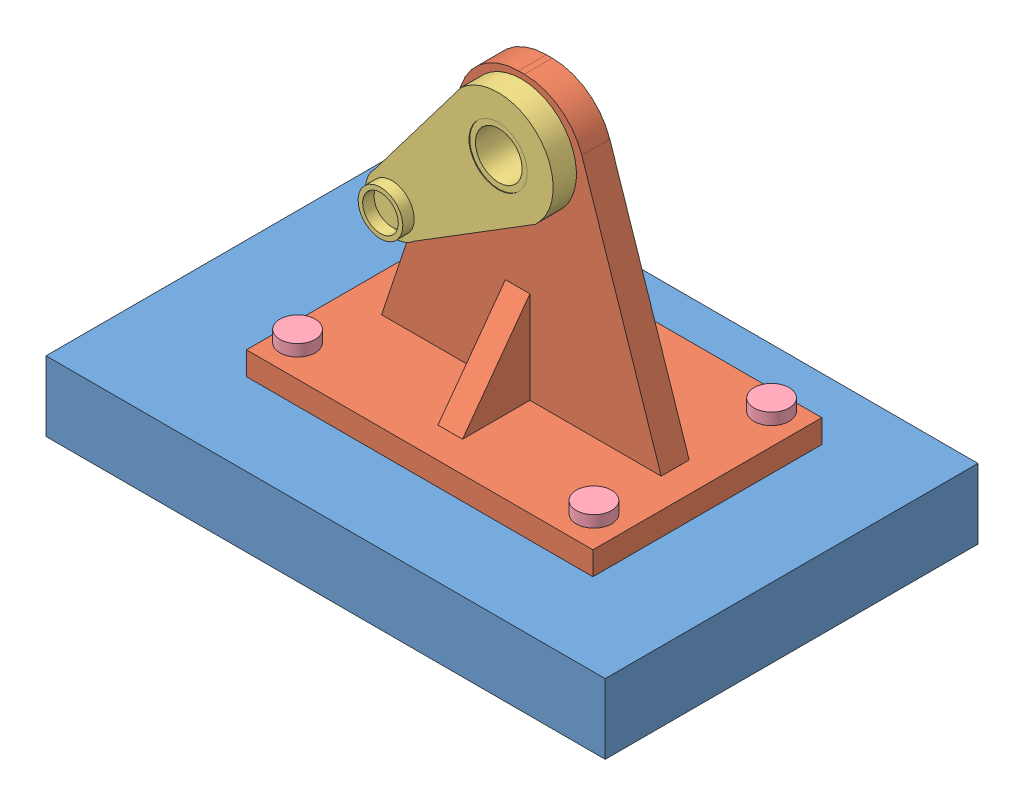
SolidWorks assembly Bill of Materials_2.SLDASM, configuration Default (file format 4100). Lengths in mm.
Overall size (152.4 106.28 101.6).
7 component instances, 4 part files, 13 mates.
Components (placement in the parent):
- bills_baseplate-1: bills_baseplate.SLDPRT [Default] at (-60.2529 -26.3738 49.7126) size (152.4 19.05 101.6)
- bills_hanger-1: bills_hanger.SLDPRT [Default] at (-17.8701 -0.9738 -6.9866) size (94.43 82.55 62.39)
- bills_hinge-1: bills_hinge.SLDPRT [Default] at (20.2299 58.7162 0.6334) x (-0.73917 -0.673518 0) z (0 0 1) size (61.03 30 19.62)
- bills_screw-1: bills_screw.SLDPRT [Default] at (58.0526 -11.1338 18.6931) size (9.6 13.33 9.6)
- bills_screw-2: bills_screw.SLDPRT [Default] at (58.0526 -11.1338 -29.716) size (9.6 13.33 9.6)
- bills_screw-3: bills_screw.SLDPRT [Default] at (-22.708 -11.1338 -29.716) size (9.6 13.33 9.6)
- bills_screw-4: bills_screw.SLDPRT [Default] at (-22.708 -11.1338 18.6931) size (9.6 13.33 9.6)
Mates (geometry in assembly coordinates):
- Coincident1: coincident anti-aligned: plane of bills_baseplate-1 through (-60.2529 -7.3238 -51.8874) normal (0 1 0); plane of bills_hanger-1 through (-28.0078 -7.3238 -35.051) normal (0 -1 0)
- Concentric4: concentric anti-aligned: cylinder of bills_hanger-1 through (20.2299 58.7162 0.6334) axis (0 0 -1) radius 7.9367; cylinder of bills_hinge-1 through (20.2299 58.7162 -9.5266) axis (0 0 1) radius 7.935
- Coincident2: coincident anti-aligned: plane of bills_hanger-1 through (21.0302 58.7162 0.6334) normal (0 0 1); plane of bills_hinge-1 through (-26.8553 87.8397 0.6334) normal (0 0 -1)
- Distance1: distance = 22.3785 mm aligned: plane of bills_baseplate-1 through (-60.2529 -7.3238 49.7126) normal (0 0 1); plane of bills_hanger-1 through (-28.0078 -7.3238 27.3341) normal (0 0 1)
- Distance2: distance = 32.2451 mm aligned: plane of bills_baseplate-1 through (-60.2529 -7.3238 49.7126) normal (-1 0 0); plane of bills_hanger-1 through (-28.0078 -7.3238 27.3341) normal (-1 0 0)
- Concentric5: concentric anti-aligned: cylinder of bills_hanger-1 through (-22.708 -10.9738 18.6931) axis (0 1 0) radius 2.8337; cylinder of bills_screw-4 through (-22.708 -0.9738 18.6931) axis (0 -1 0) radius 3.05
- Coincident3: coincident anti-aligned: plane of bills_hanger-1 through (-28.0078 -0.9738 -35.051) normal (0 1 0); plane of bills_screw-4 through (-22.708 -0.9738 18.6931) normal (0 -1 0)
- Concentric6: concentric anti-aligned: cylinder of bills_hanger-1 through (-22.708 -10.9738 -29.716) axis (0 1 0) radius 2.8337; cylinder of bills_screw-3 through (-22.708 -0.9738 -29.716) axis (0 -1 0) radius 3.05
- Coincident4: coincident anti-aligned: plane of bills_hanger-1 through (-28.0078 -0.9738 -35.051) normal (0 1 0); plane of bills_screw-3 through (-22.708 -0.9738 -29.716) normal (0 -1 0)
- Concentric7: concentric anti-aligned: cylinder of bills_hanger-1 through (58.0526 -10.9738 -29.716) axis (0 1 0) radius 3.0698; cylinder of bills_screw-2 through (58.0526 -0.9738 -29.716) axis (0 -1 0) radius 3.05
- Coincident5: coincident anti-aligned: plane of bills_hanger-1 through (-28.0078 -0.9738 -35.051) normal (0 1 0); plane of bills_screw-2 through (58.0526 -0.9738 -29.716) normal (0 -1 0)
- Concentric8: concentric anti-aligned: cylinder of bills_hanger-1 through (58.0526 -10.9738 18.6931) axis (0 1 0) radius 3.0056; cylinder of bills_screw-1 through (58.0526 -0.9738 18.6931) axis (0 -1 0) radius 3.05
- Coincident6: coincident anti-aligned: plane of bills_hanger-1 through (-28.0078 -0.9738 -35.051) normal (0 1 0); plane of bills_screw-1 through (58.0526 -0.9738 18.6931) normal (0 -1 0)
